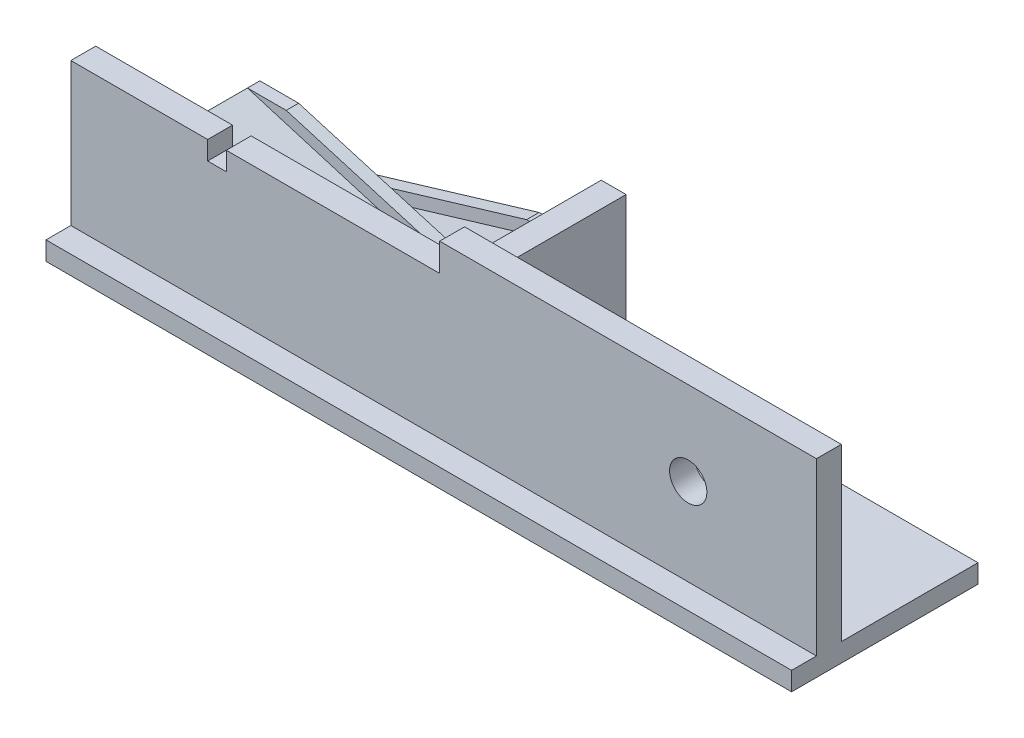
ISO-10303-21;
HEADER;
FILE_DESCRIPTION(('STEP AP214'),'2;1');
FILE_NAME('part.step','',(''),(''),'','','');
FILE_SCHEMA(('AUTOMOTIVE_DESIGN { 1 0 10303 214 1 1 1 1 }'));
ENDSEC;
DATA;
#1=APPLICATION_CONTEXT('core data for automotive mechanical design processes');
#2=APPLICATION_PROTOCOL_DEFINITION('international standard','automotive_design',2000,#1);
#3=PRODUCT_CONTEXT('',#1,'mechanical');
#4=PRODUCT('Part','Part','',(#3));
#5=PRODUCT_RELATED_PRODUCT_CATEGORY('part','',(#4));
#6=PRODUCT_DEFINITION_FORMATION('','',#4);
#7=PRODUCT_DEFINITION_CONTEXT('part definition',#1,'design');
#8=PRODUCT_DEFINITION('design','',#6,#7);
#9=PRODUCT_DEFINITION_SHAPE('','',#8);
#10=(LENGTH_UNIT() NAMED_UNIT(*) SI_UNIT(.MILLI.,.METRE.));
#11=(NAMED_UNIT(*) PLANE_ANGLE_UNIT() SI_UNIT($,.RADIAN.));
#12=(NAMED_UNIT(*) SI_UNIT($,.STERADIAN.) SOLID_ANGLE_UNIT());
#13=UNCERTAINTY_MEASURE_WITH_UNIT(LENGTH_MEASURE(1.E-05),#10,'distance_accuracy_value','');
#14=(GEOMETRIC_REPRESENTATION_CONTEXT(3) GLOBAL_UNCERTAINTY_ASSIGNED_CONTEXT((#13)) GLOBAL_UNIT_ASSIGNED_CONTEXT((#10,
#11,#12)) REPRESENTATION_CONTEXT('',''));
#15=CARTESIAN_POINT('',(0.,0.,0.));
#16=DIRECTION('',(0.,0.,1.));
#17=DIRECTION('',(1.,0.,0.));
#18=AXIS2_PLACEMENT_3D('',#15,#16,#17);
#19=CARTESIAN_POINT('',(-1000.,1450.,-1800.));
#20=DIRECTION('',(-0.287223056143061,-0.957863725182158,0.));
#21=DIRECTION('',(0.957863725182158,-0.287223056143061,0.));
#22=AXIS2_PLACEMENT_3D('',#19,#20,#21);
#23=PLANE('',#22);
#24=DIRECTION('',(0.957863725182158,-0.287223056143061,0.));
#25=VECTOR('',#24,1.);
#26=CARTESIAN_POINT('',(-1000.,1450.,-1600.));
#27=LINE('',#26,#25);
#28=CARTESIAN_POINT('',(-4294.07305936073,2437.75400549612,-1600.));
#29=VERTEX_POINT('',#28);
#30=CARTESIAN_POINT('',(-1000.,1450.,-1600.));
#31=VERTEX_POINT('',#30);
#32=EDGE_CURVE('E246',#29,#31,#27,.T.);
#33=ORIENTED_EDGE('',*,*,#32,.F.);
#34=DIRECTION('',(0.,0.,-1.));
#35=VECTOR('',#34,1.);
#36=CARTESIAN_POINT('',(-4294.07305936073,2437.75400549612,-1800.));
#37=LINE('',#36,#35);
#38=CARTESIAN_POINT('',(-4294.07305936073,2437.75400549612,-870.541736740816));
#39=VERTEX_POINT('',#38);
#40=EDGE_CURVE('E256',#39,#29,#37,.T.);
#41=ORIENTED_EDGE('',*,*,#40,.F.);
#42=DIRECTION('',(-0.950481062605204,0.285009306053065,0.123917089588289));
#43=VECTOR('',#42,1.);
#44=CARTESIAN_POINT('',(-941.109576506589,1432.34123814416,-1307.67772254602));
#45=LINE('',#44,#43);
#46=CARTESIAN_POINT('',(-4835.1492347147,2600.,-800.));
#47=VERTEX_POINT('',#46);
#48=EDGE_CURVE('E266',#39,#47,#45,.T.);
#49=ORIENTED_EDGE('',*,*,#48,.T.);
#50=DIRECTION('',(0.957863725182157,-0.287223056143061,0.));
#51=VECTOR('',#50,1.);
#52=CARTESIAN_POINT('',(-1000.,1450.,-800.));
#53=LINE('',#52,#51);
#54=CARTESIAN_POINT('',(-1000.,1450.,-800.));
#55=VERTEX_POINT('',#54);
#56=EDGE_CURVE('E327',#47,#55,#53,.T.);
#57=ORIENTED_EDGE('',*,*,#56,.T.);
#58=DIRECTION('',(0.,0.,1.));
#59=VECTOR('',#58,1.);
#60=CARTESIAN_POINT('',(-1000.,1450.,-1800.));
#61=LINE('',#60,#59);
#62=EDGE_CURVE('E258',#31,#55,#61,.T.);
#63=ORIENTED_EDGE('',*,*,#62,.F.);
#64=EDGE_LOOP('',(#33,#41,#49,#57,#63));
#65=FACE_BOUND('',#64,.T.);
#66=ADVANCED_FACE('F33',(#65),#23,.F.);
#67=CARTESIAN_POINT('',(0.,0.,-1800.));
#68=DIRECTION('',(0.,0.,-1.));
#69=DIRECTION('',(-1.,0.,0.));
#70=AXIS2_PLACEMENT_3D('',#67,#68,#69);
#71=PLANE('',#70);
#72=DIRECTION('',(-0.957863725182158,-0.287223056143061,0.));
#73=VECTOR('',#72,1.);
#74=CARTESIAN_POINT('',(-1000.,1450.,-1800.));
#75=LINE('',#74,#73);
#76=CARTESIAN_POINT('',(-1000.,1450.,-1800.));
#77=VERTEX_POINT('',#76);
#78=CARTESIAN_POINT('',(-4294.07305936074,462.245994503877,-1800.));
#79=VERTEX_POINT('',#78);
#80=EDGE_CURVE('E328',#77,#79,#75,.T.);
#81=ORIENTED_EDGE('',*,*,#80,.T.);
#82=DIRECTION('',(0.,-1.,0.));
#83=VECTOR('',#82,1.);
#84=CARTESIAN_POINT('',(-4294.07305936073,300.,-1800.));
#85=LINE('',#84,#83);
#86=CARTESIAN_POINT('',(-4294.07305936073,2437.75400549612,-1800.));
#87=VERTEX_POINT('',#86);
#88=EDGE_CURVE('E48',#87,#79,#85,.T.);
#89=ORIENTED_EDGE('',*,*,#88,.F.);
#90=DIRECTION('',(1.,0.,0.));
#91=VECTOR('',#90,1.);
#92=CARTESIAN_POINT('',(-4294.07305936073,2437.75400549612,-1800.));
#93=LINE('',#92,#91);
#94=CARTESIAN_POINT('',(-3670.18427617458,2437.75400549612,-1800.));
#95=VERTEX_POINT('',#94);
#96=EDGE_CURVE('E236',#87,#95,#93,.T.);
#97=ORIENTED_EDGE('',*,*,#96,.T.);
#98=DIRECTION('',(0.959131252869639,-0.282961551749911,0.));
#99=VECTOR('',#98,1.);
#100=CARTESIAN_POINT('',(-3670.18427617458,2437.75400549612,-1800.));
#101=LINE('',#100,#99);
#102=CARTESIAN_POINT('',(-1000.,1650.,-1800.));
#103=VERTEX_POINT('',#102);
#104=EDGE_CURVE('E915',#95,#103,#101,.T.);
#105=ORIENTED_EDGE('',*,*,#104,.T.);
#106=DIRECTION('',(0.,-1.,0.));
#107=VECTOR('',#106,1.);
#108=CARTESIAN_POINT('',(-1000.,1650.,-1800.));
#109=LINE('',#108,#107);
#110=EDGE_CURVE('E250',#103,#77,#109,.T.);
#111=ORIENTED_EDGE('',*,*,#110,.T.);
#112=EDGE_LOOP('',(#81,#89,#97,#105,#111));
#113=FACE_BOUND('',#112,.T.);
#114=ADVANCED_FACE('F486',(#113),#71,.T.);
#115=CARTESIAN_POINT('',(0.,300.,0.));
#116=DIRECTION('',(0.,-1.,0.));
#117=DIRECTION('',(0.,0.,-1.));
#118=AXIS2_PLACEMENT_3D('',#115,#116,#117);
#119=PLANE('',#118);
#120=DIRECTION('',(0.,0.,1.));
#121=VECTOR('',#120,1.);
#122=CARTESIAN_POINT('',(-4835.14923471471,300.,-3000.));
#123=LINE('',#122,#121);
#124=CARTESIAN_POINT('',(-4835.14923471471,300.,-3000.));
#125=VERTEX_POINT('',#124);
#126=CARTESIAN_POINT('',(-4835.14923471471,300.,-2800.));
#127=VERTEX_POINT('',#126);
#128=EDGE_CURVE('E295',#125,#127,#123,.T.);
#129=ORIENTED_EDGE('',*,*,#128,.F.);
#130=DIRECTION('',(-1.,0.,0.));
#131=VECTOR('',#130,1.);
#132=CARTESIAN_POINT('',(-5936.07305936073,300.,-3000.));
#133=LINE('',#132,#131);
#134=CARTESIAN_POINT('',(-5936.07305936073,300.,-3000.));
#135=VERTEX_POINT('',#134);
#136=EDGE_CURVE('E431',#125,#135,#133,.T.);
#137=ORIENTED_EDGE('',*,*,#136,.T.);
#138=DIRECTION('',(0.,0.,1.));
#139=VECTOR('',#138,1.);
#140=CARTESIAN_POINT('',(-5936.07305936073,300.,0.));
#141=LINE('',#140,#139);
#142=CARTESIAN_POINT('',(-5936.07305936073,300.,-1800.));
#143=VERTEX_POINT('',#142);
#144=EDGE_CURVE('E422',#135,#143,#141,.T.);
#145=ORIENTED_EDGE('',*,*,#144,.T.);
#146=DIRECTION('',(-1.,0.,0.));
#147=VECTOR('',#146,1.);
#148=CARTESIAN_POINT('',(-4835.14923471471,300.,-1800.));
#149=LINE('',#148,#147);
#150=CARTESIAN_POINT('',(-4835.14923471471,300.,-1800.));
#151=VERTEX_POINT('',#150);
#152=EDGE_CURVE('E331',#151,#143,#149,.T.);
#153=ORIENTED_EDGE('',*,*,#152,.F.);
#154=DIRECTION('',(0.,0.,1.));
#155=VECTOR('',#154,1.);
#156=CARTESIAN_POINT('',(-4835.14923471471,300.,-2800.));
#157=LINE('',#156,#155);
#158=EDGE_CURVE('E324',#127,#151,#157,.T.);
#159=ORIENTED_EDGE('',*,*,#158,.F.);
#160=EDGE_LOOP('',(#129,#137,#145,#153,#159));
#161=FACE_BOUND('',#160,.T.);
#162=ADVANCED_FACE('F492',(#161),#119,.F.);
#163=CARTESIAN_POINT('',(0.,2600.,-800.));
#164=DIRECTION('',(1.,0.,0.));
#165=DIRECTION('',(0.,0.,-1.));
#166=AXIS2_PLACEMENT_3D('',#163,#164,#165);
#167=PLANE('',#166);
#168=DIRECTION('',(0.,0.,1.));
#169=VECTOR('',#168,1.);
#170=CARTESIAN_POINT('',(0.,1650.,-3000.));
#171=LINE('',#170,#169);
#172=CARTESIAN_POINT('',(0.,1650.,-3000.));
#173=VERTEX_POINT('',#172);
#174=CARTESIAN_POINT('',(0.,1650.,-2800.));
#175=VERTEX_POINT('',#174);
#176=EDGE_CURVE('E56',#173,#175,#171,.T.);
#177=ORIENTED_EDGE('',*,*,#176,.T.);
#178=DIRECTION('',(0.,-1.,0.));
#179=VECTOR('',#178,1.);
#180=CARTESIAN_POINT('',(0.,1650.,-2800.));
#181=LINE('',#180,#179);
#182=CARTESIAN_POINT('',(0.,950.,-2800.));
#183=VERTEX_POINT('',#182);
#184=EDGE_CURVE('E290',#175,#183,#181,.T.);
#185=ORIENTED_EDGE('',*,*,#184,.T.);
#186=DIRECTION('',(0.,0.,1.));
#187=VECTOR('',#186,1.);
#188=CARTESIAN_POINT('',(0.,950.,-2800.));
#189=LINE('',#188,#187);
#190=CARTESIAN_POINT('',(0.,950.,-800.));
#191=VERTEX_POINT('',#190);
#192=EDGE_CURVE('E313',#183,#191,#189,.T.);
#193=ORIENTED_EDGE('',*,*,#192,.T.);
#194=DIRECTION('',(0.,-1.,0.));
#195=VECTOR('',#194,1.);
#196=CARTESIAN_POINT('',(0.,2600.,-800.));
#197=LINE('',#196,#195);
#198=CARTESIAN_POINT('',(0.,2600.,-800.));
#199=VERTEX_POINT('',#198);
#200=EDGE_CURVE('E372',#199,#191,#197,.T.);
#201=ORIENTED_EDGE('',*,*,#200,.F.);
#202=DIRECTION('',(0.,0.,1.));
#203=VECTOR('',#202,1.);
#204=CARTESIAN_POINT('',(0.,2600.,-800.));
#205=LINE('',#204,#203);
#206=CARTESIAN_POINT('',(0.,2600.,-3000.));
#207=VERTEX_POINT('',#206);
#208=EDGE_CURVE('E357',#207,#199,#205,.T.);
#209=ORIENTED_EDGE('',*,*,#208,.F.);
#210=DIRECTION('',(0.,-1.,0.));
#211=VECTOR('',#210,1.);
#212=CARTESIAN_POINT('',(0.,2600.,-3000.));
#213=LINE('',#212,#211);
#214=EDGE_CURVE('E364',#207,#173,#213,.T.);
#215=ORIENTED_EDGE('',*,*,#214,.T.);
#216=EDGE_LOOP('',(#177,#185,#193,#201,#209,#215));
#217=FACE_BOUND('',#216,.T.);
#218=ADVANCED_FACE('F504',(#217),#167,.F.);
#219=CARTESIAN_POINT('',(-5936.07305936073,2600.,-800.));
#220=DIRECTION('',(0.,0.,1.));
#221=DIRECTION('',(1.,0.,0.));
#222=AXIS2_PLACEMENT_3D('',#219,#220,#221);
#223=PLANE('',#222);
#224=DIRECTION('',(0.,-1.,0.));
#225=VECTOR('',#224,1.);
#226=CARTESIAN_POINT('',(-1000.,1450.,-800.));
#227=LINE('',#226,#225);
#228=CARTESIAN_POINT('',(-1000.,950.,-800.));
#229=VERTEX_POINT('',#228);
#230=EDGE_CURVE('E302',#55,#229,#227,.T.);
#231=ORIENTED_EDGE('',*,*,#230,.F.);
#232=ORIENTED_EDGE('',*,*,#56,.F.);
#233=DIRECTION('',(-1.,0.,0.));
#234=VECTOR('',#233,1.);
#235=CARTESIAN_POINT('',(-5936.07305936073,2600.,-800.));
#236=LINE('',#235,#234);
#237=CARTESIAN_POINT('',(-3734.22541006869,2600.,-800.));
#238=VERTEX_POINT('',#237);
#239=EDGE_CURVE('E405',#238,#47,#236,.T.);
#240=ORIENTED_EDGE('',*,*,#239,.F.);
#241=DIRECTION('',(0.,-1.,0.));
#242=VECTOR('',#241,1.);
#243=CARTESIAN_POINT('',(-3734.22541006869,2600.,-800.));
#244=LINE('',#243,#242);
#245=CARTESIAN_POINT('',(-3734.22541006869,2300.,-800.));
#246=VERTEX_POINT('',#245);
#247=EDGE_CURVE('E394',#238,#246,#244,.T.);
#248=ORIENTED_EDGE('',*,*,#247,.T.);
#249=DIRECTION('',(1.,0.,0.));
#250=VECTOR('',#249,1.);
#251=CARTESIAN_POINT('',(-5936.07305936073,2300.,-800.));
#252=LINE('',#251,#250);
#253=CARTESIAN_POINT('',(-3434.22541006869,2300.,-800.));
#254=VERTEX_POINT('',#253);
#255=EDGE_CURVE('E41',#246,#254,#252,.T.);
#256=ORIENTED_EDGE('',*,*,#255,.T.);
#257=DIRECTION('',(0.,1.,0.));
#258=VECTOR('',#257,1.);
#259=CARTESIAN_POINT('',(-3434.22541006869,2600.,-800.));
#260=LINE('',#259,#258);
#261=CARTESIAN_POINT('',(-3434.22541006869,2600.,-800.));
#262=VERTEX_POINT('',#261);
#263=EDGE_CURVE('E390',#254,#262,#260,.T.);
#264=ORIENTED_EDGE('',*,*,#263,.T.);
#265=EDGE_CURVE('E406',#199,#262,#236,.T.);
#266=ORIENTED_EDGE('',*,*,#265,.F.);
#267=ORIENTED_EDGE('',*,*,#200,.T.);
#268=DIRECTION('',(1.,0.,0.));
#269=VECTOR('',#268,1.);
#270=CARTESIAN_POINT('',(-1000.,950.,-800.));
#271=LINE('',#270,#269);
#272=EDGE_CURVE('E307',#229,#191,#271,.T.);
#273=ORIENTED_EDGE('',*,*,#272,.F.);
#274=EDGE_LOOP('',(#231,#232,#240,#248,#256,#264,#266,#267,#273));
#275=FACE_BOUND('',#274,.T.);
#276=ADVANCED_FACE('F506',(#275),#223,.F.);
#277=CARTESIAN_POINT('',(0.,2600.,0.));
#278=DIRECTION('',(0.,-1.,0.));
#279=DIRECTION('',(0.,0.,-1.));
#280=AXIS2_PLACEMENT_3D('',#277,#278,#279);
#281=PLANE('',#280);
#282=DIRECTION('',(0.,0.,1.));
#283=VECTOR('',#282,1.);
#284=CARTESIAN_POINT('',(0.,2600.,-400.));
#285=LINE('',#284,#283);
#286=CARTESIAN_POINT('',(0.,2600.,-400.));
#287=VERTEX_POINT('',#286);
#288=EDGE_CURVE('E336',#199,#287,#285,.T.);
#289=ORIENTED_EDGE('',*,*,#288,.F.);
#290=ORIENTED_EDGE('',*,*,#265,.T.);
#291=DIRECTION('',(0.,0.,1.));
#292=VECTOR('',#291,1.);
#293=CARTESIAN_POINT('',(-3434.22541006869,2600.,0.));
#294=LINE('',#293,#292);
#295=CARTESIAN_POINT('',(-3434.22541006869,2600.,-400.));
#296=VERTEX_POINT('',#295);
#297=EDGE_CURVE('E455',#262,#296,#294,.T.);
#298=ORIENTED_EDGE('',*,*,#297,.T.);
#299=DIRECTION('',(1.,0.,0.));
#300=VECTOR('',#299,1.);
#301=CARTESIAN_POINT('',(-5936.07305936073,2600.,-400.));
#302=LINE('',#301,#300);
#303=EDGE_CURVE('E400',#296,#287,#302,.T.);
#304=ORIENTED_EDGE('',*,*,#303,.T.);
#305=EDGE_LOOP('',(#289,#290,#298,#304));
#306=FACE_BOUND('',#305,.T.);
#307=ADVANCED_FACE('F511',(#306),#281,.F.);
#308=DIRECTION('',(-1.,0.,0.));
#309=VECTOR('',#308,1.);
#310=CARTESIAN_POINT('',(0.,2600.,-800.));
#311=LINE('',#310,#309);
#312=CARTESIAN_POINT('',(400.,2600.,-800.));
#313=VERTEX_POINT('',#312);
#314=EDGE_CURVE('E11',#313,#199,#311,.T.);
#315=ORIENTED_EDGE('',*,*,#314,.F.);
#316=DIRECTION('',(0.,0.,-1.));
#317=VECTOR('',#316,1.);
#318=CARTESIAN_POINT('',(400.,2600.,-800.));
#319=LINE('',#318,#317);
#320=CARTESIAN_POINT('',(400.,2600.,-3000.));
#321=VERTEX_POINT('',#320);
#322=EDGE_CURVE('E360',#313,#321,#319,.T.);
#323=ORIENTED_EDGE('',*,*,#322,.T.);
#324=DIRECTION('',(-1.,0.,0.));
#325=VECTOR('',#324,1.);
#326=CARTESIAN_POINT('',(0.,2600.,-3000.));
#327=LINE('',#326,#325);
#328=EDGE_CURVE('E362',#321,#207,#327,.T.);
#329=ORIENTED_EDGE('',*,*,#328,.T.);
#330=ORIENTED_EDGE('',*,*,#208,.T.);
#331=EDGE_LOOP('',(#315,#323,#329,#330));
#332=FACE_BOUND('',#331,.T.);
#333=ADVANCED_FACE('F524',(#332),#281,.F.);
#334=DIRECTION('',(0.,0.,-1.));
#335=VECTOR('',#334,1.);
#336=CARTESIAN_POINT('',(400.,300.,-800.));
#337=LINE('',#336,#335);
#338=CARTESIAN_POINT('',(400.,300.,-800.));
#339=VERTEX_POINT('',#338);
#340=CARTESIAN_POINT('',(400.,300.,-3000.));
#341=VERTEX_POINT('',#340);
#342=EDGE_CURVE('E356',#339,#341,#337,.T.);
#343=ORIENTED_EDGE('',*,*,#342,.F.);
#344=DIRECTION('',(-1.,0.,0.));
#345=VECTOR('',#344,1.);
#346=CARTESIAN_POINT('',(-5936.07305936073,300.,-800.));
#347=LINE('',#346,#345);
#348=CARTESIAN_POINT('',(6063.92694063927,300.,-800.));
#349=VERTEX_POINT('',#348);
#350=EDGE_CURVE('E401',#349,#339,#347,.T.);
#351=ORIENTED_EDGE('',*,*,#350,.F.);
#352=DIRECTION('',(0.,0.,-1.));
#353=VECTOR('',#352,1.);
#354=CARTESIAN_POINT('',(6063.92694063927,300.,0.));
#355=LINE('',#354,#353);
#356=CARTESIAN_POINT('',(6063.92694063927,300.,-3000.));
#357=VERTEX_POINT('',#356);
#358=EDGE_CURVE('E428',#349,#357,#355,.T.);
#359=ORIENTED_EDGE('',*,*,#358,.T.);
#360=EDGE_CURVE('E432',#357,#341,#133,.T.);
#361=ORIENTED_EDGE('',*,*,#360,.T.);
#362=EDGE_LOOP('',(#343,#351,#359,#361));
#363=FACE_BOUND('',#362,.T.);
#364=ADVANCED_FACE('F517',(#363),#119,.F.);
#365=CARTESIAN_POINT('',(4000.,1700.,-800.));
#366=DIRECTION('',(0.,0.,1.));
#367=DIRECTION('',(1.,0.,0.));
#368=AXIS2_PLACEMENT_3D('',#365,#366,#367);
#369=CIRCLE('',#368,300.);
#370=CARTESIAN_POINT('',(4300.,1700.,-800.));
#371=VERTEX_POINT('',#370);
#372=EDGE_CURVE('E378',#371,#371,#369,.T.);
#373=ORIENTED_EDGE('',*,*,#372,.T.);
#374=EDGE_LOOP('',(#373));
#375=FACE_BOUND('',#374,.T.);
#376=DIRECTION('',(0.,-1.,0.));
#377=VECTOR('',#376,1.);
#378=CARTESIAN_POINT('',(400.,2600.,-800.));
#379=LINE('',#378,#377);
#380=EDGE_CURVE('E370',#313,#339,#379,.T.);
#381=ORIENTED_EDGE('',*,*,#380,.F.);
#382=ORIENTED_EDGE('',*,*,#314,.T.);
#383=DIRECTION('',(0.,-1.,0.));
#384=VECTOR('',#383,1.);
#385=CARTESIAN_POINT('',(0.,3050.,-800.));
#386=LINE('',#385,#384);
#387=CARTESIAN_POINT('',(0.,3050.,-800.));
#388=VERTEX_POINT('',#387);
#389=EDGE_CURVE('E348',#388,#199,#386,.T.);
#390=ORIENTED_EDGE('',*,*,#389,.F.);
#391=DIRECTION('',(-1.,0.,0.));
#392=VECTOR('',#391,1.);
#393=CARTESIAN_POINT('',(0.,3050.,-800.));
#394=LINE('',#393,#392);
#395=CARTESIAN_POINT('',(6063.92694063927,3050.,-800.));
#396=VERTEX_POINT('',#395);
#397=EDGE_CURVE('E346',#396,#388,#394,.T.);
#398=ORIENTED_EDGE('',*,*,#397,.F.);
#399=DIRECTION('',(0.,-1.,0.));
#400=VECTOR('',#399,1.);
#401=CARTESIAN_POINT('',(6063.92694063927,2600.,-800.));
#402=LINE('',#401,#400);
#403=EDGE_CURVE('E408',#396,#349,#402,.T.);
#404=ORIENTED_EDGE('',*,*,#403,.T.);
#405=ORIENTED_EDGE('',*,*,#350,.T.);
#406=EDGE_LOOP('',(#381,#382,#390,#398,#404,#405));
#407=FACE_BOUND('',#406,.T.);
#408=ADVANCED_FACE('F465',(#375,#407),#223,.F.);
#409=ORIENTED_EDGE('',*,*,#239,.T.);
#410=DIRECTION('',(-1.,0.,0.));
#411=VECTOR('',#410,1.);
#412=CARTESIAN_POINT('',(-4294.07305936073,2600.,-800.));
#413=LINE('',#412,#411);
#414=CARTESIAN_POINT('',(-5936.07305936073,2600.,-800.));
#415=VERTEX_POINT('',#414);
#416=EDGE_CURVE('E267',#47,#415,#413,.T.);
#417=ORIENTED_EDGE('',*,*,#416,.T.);
#418=DIRECTION('',(0.,0.,1.));
#419=VECTOR('',#418,1.);
#420=CARTESIAN_POINT('',(-5936.07305936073,2600.,-400.));
#421=LINE('',#420,#419);
#422=CARTESIAN_POINT('',(-5936.07305936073,2600.,-400.));
#423=VERTEX_POINT('',#422);
#424=EDGE_CURVE('E398',#415,#423,#421,.T.);
#425=ORIENTED_EDGE('',*,*,#424,.T.);
#426=CARTESIAN_POINT('',(-3734.22541006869,2600.,-400.));
#427=VERTEX_POINT('',#426);
#428=EDGE_CURVE('E402',#423,#427,#302,.T.);
#429=ORIENTED_EDGE('',*,*,#428,.T.);
#430=DIRECTION('',(0.,0.,-1.));
#431=VECTOR('',#430,1.);
#432=CARTESIAN_POINT('',(-3734.22541006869,2600.,0.));
#433=LINE('',#432,#431);
#434=EDGE_CURVE('E458',#427,#238,#433,.T.);
#435=ORIENTED_EDGE('',*,*,#434,.T.);
#436=EDGE_LOOP('',(#409,#417,#425,#429,#435));
#437=FACE_BOUND('',#436,.T.);
#438=ADVANCED_FACE('F527',(#437),#281,.F.);
#439=DIRECTION('',(1.,0.,0.));
#440=VECTOR('',#439,1.);
#441=CARTESIAN_POINT('',(-5936.07305936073,300.,-400.));
#442=LINE('',#441,#440);
#443=CARTESIAN_POINT('',(-5936.07305936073,300.,-400.));
#444=VERTEX_POINT('',#443);
#445=CARTESIAN_POINT('',(6063.92694063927,300.,-400.));
#446=VERTEX_POINT('',#445);
#447=EDGE_CURVE('E397',#444,#446,#442,.T.);
#448=ORIENTED_EDGE('',*,*,#447,.F.);
#449=CARTESIAN_POINT('',(-5936.07305936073,300.,0.));
#450=VERTEX_POINT('',#449);
#451=EDGE_CURVE('E426',#444,#450,#141,.T.);
#452=ORIENTED_EDGE('',*,*,#451,.T.);
#453=DIRECTION('',(1.,0.,0.));
#454=VECTOR('',#453,1.);
#455=CARTESIAN_POINT('',(-5936.07305936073,300.,0.));
#456=LINE('',#455,#454);
#457=CARTESIAN_POINT('',(6063.92694063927,300.,0.));
#458=VERTEX_POINT('',#457);
#459=EDGE_CURVE('E425',#450,#458,#456,.T.);
#460=ORIENTED_EDGE('',*,*,#459,.T.);
#461=EDGE_CURVE('E429',#458,#446,#355,.T.);
#462=ORIENTED_EDGE('',*,*,#461,.T.);
#463=EDGE_LOOP('',(#448,#452,#460,#462));
#464=FACE_BOUND('',#463,.T.);
#465=ADVANCED_FACE('F518',(#464),#119,.F.);
#466=CARTESIAN_POINT('',(-5936.07305936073,300.,0.));
#467=DIRECTION('',(1.,0.,0.));
#468=DIRECTION('',(0.,0.,-1.));
#469=AXIS2_PLACEMENT_3D('',#466,#467,#468);
#470=PLANE('',#469);
#471=ORIENTED_EDGE('',*,*,#424,.F.);
#472=DIRECTION('',(0.,0.917070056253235,0.39872611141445));
#473=VECTOR('',#472,1.);
#474=CARTESIAN_POINT('',(-5936.07305936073,2600.,-800.));
#475=LINE('',#474,#473);
#476=EDGE_CURVE('E259',#143,#415,#475,.T.);
#477=ORIENTED_EDGE('',*,*,#476,.F.);
#478=ORIENTED_EDGE('',*,*,#144,.F.);
#479=DIRECTION('',(0.,-1.,0.));
#480=VECTOR('',#479,1.);
#481=CARTESIAN_POINT('',(-5936.07305936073,300.,-3000.));
#482=LINE('',#481,#480);
#483=CARTESIAN_POINT('',(-5936.07305936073,0.,-3000.));
#484=VERTEX_POINT('',#483);
#485=EDGE_CURVE('E435',#135,#484,#482,.T.);
#486=ORIENTED_EDGE('',*,*,#485,.T.);
#487=DIRECTION('',(0.,0.,1.));
#488=VECTOR('',#487,1.);
#489=CARTESIAN_POINT('',(-5936.07305936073,0.,0.));
#490=LINE('',#489,#488);
#491=CARTESIAN_POINT('',(-5936.07305936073,0.,0.));
#492=VERTEX_POINT('',#491);
#493=EDGE_CURVE('E421',#484,#492,#490,.T.);
#494=ORIENTED_EDGE('',*,*,#493,.T.);
#495=DIRECTION('',(0.,-1.,0.));
#496=VECTOR('',#495,1.);
#497=CARTESIAN_POINT('',(-5936.07305936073,300.,0.));
#498=LINE('',#497,#496);
#499=EDGE_CURVE('E452',#450,#492,#498,.T.);
#500=ORIENTED_EDGE('',*,*,#499,.F.);
#501=ORIENTED_EDGE('',*,*,#451,.F.);
#502=DIRECTION('',(0.,-1.,0.));
#503=VECTOR('',#502,1.);
#504=CARTESIAN_POINT('',(-5936.07305936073,2600.,-400.));
#505=LINE('',#504,#503);
#506=EDGE_CURVE('E418',#423,#444,#505,.T.);
#507=ORIENTED_EDGE('',*,*,#506,.F.);
#508=EDGE_LOOP('',(#471,#477,#478,#486,#494,#500,#501,#507));
#509=FACE_BOUND('',#508,.T.);
#510=ADVANCED_FACE('F35',(#509),#470,.F.);
#511=CARTESIAN_POINT('',(-5936.07305936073,300.,0.));
#512=DIRECTION('',(0.,0.,-1.));
#513=DIRECTION('',(-1.,0.,0.));
#514=AXIS2_PLACEMENT_3D('',#511,#512,#513);
#515=PLANE('',#514);
#516=DIRECTION('',(1.,0.,0.));
#517=VECTOR('',#516,1.);
#518=CARTESIAN_POINT('',(-5936.07305936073,0.,0.));
#519=LINE('',#518,#517);
#520=CARTESIAN_POINT('',(6063.92694063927,0.,0.));
#521=VERTEX_POINT('',#520);
#522=EDGE_CURVE('E438',#492,#521,#519,.T.);
#523=ORIENTED_EDGE('',*,*,#522,.T.);
#524=DIRECTION('',(0.,-1.,0.));
#525=VECTOR('',#524,1.);
#526=CARTESIAN_POINT('',(6063.92694063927,300.,0.));
#527=LINE('',#526,#525);
#528=EDGE_CURVE('E449',#458,#521,#527,.T.);
#529=ORIENTED_EDGE('',*,*,#528,.F.);
#530=ORIENTED_EDGE('',*,*,#459,.F.);
#531=ORIENTED_EDGE('',*,*,#499,.T.);
#532=EDGE_LOOP('',(#523,#529,#530,#531));
#533=FACE_BOUND('',#532,.T.);
#534=ADVANCED_FACE('F533',(#533),#515,.F.);
#535=CARTESIAN_POINT('',(6063.92694063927,300.,0.));
#536=DIRECTION('',(-1.,0.,0.));
#537=DIRECTION('',(0.,0.,1.));
#538=AXIS2_PLACEMENT_3D('',#535,#536,#537);
#539=PLANE('',#538);
#540=DIRECTION('',(0.,0.,-1.));
#541=VECTOR('',#540,1.);
#542=CARTESIAN_POINT('',(6063.92694063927,0.,0.));
#543=LINE('',#542,#541);
#544=CARTESIAN_POINT('',(6063.92694063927,0.,-3000.));
#545=VERTEX_POINT('',#544);
#546=EDGE_CURVE('E440',#521,#545,#543,.T.);
#547=ORIENTED_EDGE('',*,*,#546,.T.);
#548=DIRECTION('',(0.,-1.,0.));
#549=VECTOR('',#548,1.);
#550=CARTESIAN_POINT('',(6063.92694063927,300.,-3000.));
#551=LINE('',#550,#549);
#552=EDGE_CURVE('E446',#357,#545,#551,.T.);
#553=ORIENTED_EDGE('',*,*,#552,.F.);
#554=ORIENTED_EDGE('',*,*,#358,.F.);
#555=ORIENTED_EDGE('',*,*,#403,.F.);
#556=DIRECTION('',(0.,0.,-1.));
#557=VECTOR('',#556,1.);
#558=CARTESIAN_POINT('',(6063.92694063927,3050.,-400.));
#559=LINE('',#558,#557);
#560=CARTESIAN_POINT('',(6063.92694063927,3050.,-400.));
#561=VERTEX_POINT('',#560);
#562=EDGE_CURVE('E343',#561,#396,#559,.T.);
#563=ORIENTED_EDGE('',*,*,#562,.F.);
#564=DIRECTION('',(0.,-1.,0.));
#565=VECTOR('',#564,1.);
#566=CARTESIAN_POINT('',(6063.92694063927,2600.,-400.));
#567=LINE('',#566,#565);
#568=EDGE_CURVE('E415',#561,#446,#567,.T.);
#569=ORIENTED_EDGE('',*,*,#568,.T.);
#570=ORIENTED_EDGE('',*,*,#461,.F.);
#571=ORIENTED_EDGE('',*,*,#528,.T.);
#572=EDGE_LOOP('',(#547,#553,#554,#555,#563,#569,#570,#571));
#573=FACE_BOUND('',#572,.T.);
#574=ADVANCED_FACE('F571',(#573),#539,.F.);
#575=CARTESIAN_POINT('',(-5936.07305936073,300.,-3000.));
#576=DIRECTION('',(0.,0.,1.));
#577=DIRECTION('',(1.,0.,0.));
#578=AXIS2_PLACEMENT_3D('',#575,#576,#577);
#579=PLANE('',#578);
#580=DIRECTION('',(-1.,0.,0.));
#581=VECTOR('',#580,1.);
#582=CARTESIAN_POINT('',(-5936.07305936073,0.,-3000.));
#583=LINE('',#582,#581);
#584=EDGE_CURVE('E442',#545,#484,#583,.T.);
#585=ORIENTED_EDGE('',*,*,#584,.T.);
#586=ORIENTED_EDGE('',*,*,#485,.F.);
#587=ORIENTED_EDGE('',*,*,#136,.F.);
#588=DIRECTION('',(0.,1.,0.));
#589=VECTOR('',#588,1.);
#590=CARTESIAN_POINT('',(-4835.14923471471,300.,-3000.));
#591=LINE('',#590,#589);
#592=CARTESIAN_POINT('',(-4835.14923471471,500.,-3000.));
#593=VERTEX_POINT('',#592);
#594=EDGE_CURVE('E283',#125,#593,#591,.T.);
#595=ORIENTED_EDGE('',*,*,#594,.T.);
#596=DIRECTION('',(0.957863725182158,0.287223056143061,0.));
#597=VECTOR('',#596,1.);
#598=CARTESIAN_POINT('',(-4835.14923471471,500.,-3000.));
#599=LINE('',#598,#597);
#600=CARTESIAN_POINT('',(-1000.,1650.,-3000.));
#601=VERTEX_POINT('',#600);
#602=EDGE_CURVE('E276',#593,#601,#599,.T.);
#603=ORIENTED_EDGE('',*,*,#602,.T.);
#604=DIRECTION('',(1.,0.,0.));
#605=VECTOR('',#604,1.);
#606=CARTESIAN_POINT('',(-1000.,1650.,-3000.));
#607=LINE('',#606,#605);
#608=EDGE_CURVE('E279',#601,#173,#607,.T.);
#609=ORIENTED_EDGE('',*,*,#608,.T.);
#610=ORIENTED_EDGE('',*,*,#214,.F.);
#611=ORIENTED_EDGE('',*,*,#328,.F.);
#612=DIRECTION('',(0.,-1.,0.));
#613=VECTOR('',#612,1.);
#614=CARTESIAN_POINT('',(400.,2600.,-3000.));
#615=LINE('',#614,#613);
#616=EDGE_CURVE('E367',#321,#341,#615,.T.);
#617=ORIENTED_EDGE('',*,*,#616,.T.);
#618=ORIENTED_EDGE('',*,*,#360,.F.);
#619=ORIENTED_EDGE('',*,*,#552,.T.);
#620=EDGE_LOOP('',(#585,#586,#587,#595,#603,#609,#610,#611,#617,#618,#619));
#621=FACE_BOUND('',#620,.T.);
#622=ADVANCED_FACE('F562',(#621),#579,.F.);
#623=CARTESIAN_POINT('',(0.,0.,0.));
#624=DIRECTION('',(0.,-1.,0.));
#625=DIRECTION('',(0.,0.,-1.));
#626=AXIS2_PLACEMENT_3D('',#623,#624,#625);
#627=PLANE('',#626);
#628=ORIENTED_EDGE('',*,*,#493,.F.);
#629=ORIENTED_EDGE('',*,*,#584,.F.);
#630=ORIENTED_EDGE('',*,*,#546,.F.);
#631=ORIENTED_EDGE('',*,*,#522,.F.);
#632=EDGE_LOOP('',(#628,#629,#630,#631));
#633=FACE_BOUND('',#632,.T.);
#634=ADVANCED_FACE('F566',(#633),#627,.T.);
#635=CARTESIAN_POINT('',(-5936.07305936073,2600.,-400.));
#636=DIRECTION('',(0.,0.,-1.));
#637=DIRECTION('',(-1.,0.,0.));
#638=AXIS2_PLACEMENT_3D('',#635,#636,#637);
#639=PLANE('',#638);
#640=CARTESIAN_POINT('',(4000.,1700.,-400.));
#641=DIRECTION('',(0.,0.,1.));
#642=DIRECTION('',(1.,0.,0.));
#643=AXIS2_PLACEMENT_3D('',#640,#641,#642);
#644=CIRCLE('',#643,300.);
#645=CARTESIAN_POINT('',(4300.,1700.,-400.));
#646=VERTEX_POINT('',#645);
#647=EDGE_CURVE('E375',#646,#646,#644,.T.);
#648=ORIENTED_EDGE('',*,*,#647,.F.);
#649=EDGE_LOOP('',(#648));
#650=FACE_BOUND('',#649,.T.);
#651=DIRECTION('',(1.,0.,0.));
#652=VECTOR('',#651,1.);
#653=CARTESIAN_POINT('',(-3734.22541006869,2300.,-400.));
#654=LINE('',#653,#652);
#655=CARTESIAN_POINT('',(-3734.22541006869,2300.,-400.));
#656=VERTEX_POINT('',#655);
#657=CARTESIAN_POINT('',(-3434.22541006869,2300.,-400.));
#658=VERTEX_POINT('',#657);
#659=EDGE_CURVE('E382',#656,#658,#654,.T.);
#660=ORIENTED_EDGE('',*,*,#659,.F.);
#661=DIRECTION('',(0.,-1.,0.));
#662=VECTOR('',#661,1.);
#663=CARTESIAN_POINT('',(-3734.22541006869,2600.,-400.));
#664=LINE('',#663,#662);
#665=EDGE_CURVE('E379',#427,#656,#664,.T.);
#666=ORIENTED_EDGE('',*,*,#665,.F.);
#667=ORIENTED_EDGE('',*,*,#428,.F.);
#668=ORIENTED_EDGE('',*,*,#506,.T.);
#669=ORIENTED_EDGE('',*,*,#447,.T.);
#670=ORIENTED_EDGE('',*,*,#568,.F.);
#671=DIRECTION('',(1.,0.,0.));
#672=VECTOR('',#671,1.);
#673=CARTESIAN_POINT('',(0.,3050.,-400.));
#674=LINE('',#673,#672);
#675=CARTESIAN_POINT('',(0.,3050.,-400.));
#676=VERTEX_POINT('',#675);
#677=EDGE_CURVE('E340',#676,#561,#674,.T.);
#678=ORIENTED_EDGE('',*,*,#677,.F.);
#679=DIRECTION('',(0.,-1.,0.));
#680=VECTOR('',#679,1.);
#681=CARTESIAN_POINT('',(0.,3050.,-400.));
#682=LINE('',#681,#680);
#683=EDGE_CURVE('E353',#676,#287,#682,.T.);
#684=ORIENTED_EDGE('',*,*,#683,.T.);
#685=ORIENTED_EDGE('',*,*,#303,.F.);
#686=DIRECTION('',(0.,1.,0.));
#687=VECTOR('',#686,1.);
#688=CARTESIAN_POINT('',(-3434.22541006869,2600.,-400.));
#689=LINE('',#688,#687);
#690=EDGE_CURVE('E385',#658,#296,#689,.T.);
#691=ORIENTED_EDGE('',*,*,#690,.F.);
#692=EDGE_LOOP('',(#660,#666,#667,#668,#669,#670,#678,#684,#685,#691));
#693=FACE_BOUND('',#692,.T.);
#694=ADVANCED_FACE('F547',(#650,#693),#639,.F.);
#695=CARTESIAN_POINT('',(-3734.22541006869,2300.,-2700.));
#696=DIRECTION('',(0.,-1.,0.));
#697=DIRECTION('',(0.,0.,-1.));
#698=AXIS2_PLACEMENT_3D('',#695,#696,#697);
#699=PLANE('',#698);
#700=DIRECTION('',(0.,0.,1.));
#701=VECTOR('',#700,1.);
#702=CARTESIAN_POINT('',(-3734.22541006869,2300.,-2700.));
#703=LINE('',#702,#701);
#704=EDGE_CURVE('E387',#246,#656,#703,.T.);
#705=ORIENTED_EDGE('',*,*,#704,.T.);
#706=ORIENTED_EDGE('',*,*,#659,.T.);
#707=DIRECTION('',(0.,0.,1.));
#708=VECTOR('',#707,1.);
#709=CARTESIAN_POINT('',(-3434.22541006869,2300.,-2700.));
#710=LINE('',#709,#708);
#711=EDGE_CURVE('E388',#254,#658,#710,.T.);
#712=ORIENTED_EDGE('',*,*,#711,.F.);
#713=ORIENTED_EDGE('',*,*,#255,.F.);
#714=EDGE_LOOP('',(#705,#706,#712,#713));
#715=FACE_BOUND('',#714,.T.);
#716=ADVANCED_FACE('F586',(#715),#699,.F.);
#717=CARTESIAN_POINT('',(-3734.22541006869,2600.,-2700.));
#718=DIRECTION('',(-1.,0.,0.));
#719=DIRECTION('',(0.,0.,1.));
#720=AXIS2_PLACEMENT_3D('',#717,#718,#719);
#721=PLANE('',#720);
#722=ORIENTED_EDGE('',*,*,#434,.F.);
#723=ORIENTED_EDGE('',*,*,#665,.T.);
#724=ORIENTED_EDGE('',*,*,#704,.F.);
#725=ORIENTED_EDGE('',*,*,#247,.F.);
#726=EDGE_LOOP('',(#722,#723,#724,#725));
#727=FACE_BOUND('',#726,.T.);
#728=ADVANCED_FACE('F481',(#727),#721,.F.);
#729=CARTESIAN_POINT('',(-3434.22541006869,2600.,-2700.));
#730=DIRECTION('',(1.,0.,0.));
#731=DIRECTION('',(0.,0.,-1.));
#732=AXIS2_PLACEMENT_3D('',#729,#730,#731);
#733=PLANE('',#732);
#734=ORIENTED_EDGE('',*,*,#711,.T.);
#735=ORIENTED_EDGE('',*,*,#690,.T.);
#736=ORIENTED_EDGE('',*,*,#297,.F.);
#737=ORIENTED_EDGE('',*,*,#263,.F.);
#738=EDGE_LOOP('',(#734,#735,#736,#737));
#739=FACE_BOUND('',#738,.T.);
#740=ADVANCED_FACE('F471',(#739),#733,.F.);
#741=CARTESIAN_POINT('',(4000.,1700.,-2700.));
#742=DIRECTION('',(0.,0.,1.));
#743=DIRECTION('',(1.,0.,0.));
#744=AXIS2_PLACEMENT_3D('',#741,#742,#743);
#745=CYLINDRICAL_SURFACE('',#744,300.);
#746=ORIENTED_EDGE('',*,*,#647,.T.);
#747=EDGE_LOOP('',(#746));
#748=FACE_BOUND('',#747,.T.);
#749=ORIENTED_EDGE('',*,*,#372,.F.);
#750=EDGE_LOOP('',(#749));
#751=FACE_BOUND('',#750,.T.);
#752=ADVANCED_FACE('F468',(#748,#751),#745,.F.);
#753=CARTESIAN_POINT('',(400.,2600.,-800.));
#754=DIRECTION('',(-1.,0.,0.));
#755=DIRECTION('',(0.,0.,1.));
#756=AXIS2_PLACEMENT_3D('',#753,#754,#755);
#757=PLANE('',#756);
#758=ORIENTED_EDGE('',*,*,#342,.T.);
#759=ORIENTED_EDGE('',*,*,#616,.F.);
#760=ORIENTED_EDGE('',*,*,#322,.F.);
#761=ORIENTED_EDGE('',*,*,#380,.T.);
#762=EDGE_LOOP('',(#758,#759,#760,#761));
#763=FACE_BOUND('',#762,.T.);
#764=ADVANCED_FACE('F470',(#763),#757,.F.);
#765=CARTESIAN_POINT('',(0.,3050.,-400.));
#766=DIRECTION('',(1.,0.,0.));
#767=DIRECTION('',(0.,0.,-1.));
#768=AXIS2_PLACEMENT_3D('',#765,#766,#767);
#769=PLANE('',#768);
#770=ORIENTED_EDGE('',*,*,#288,.T.);
#771=ORIENTED_EDGE('',*,*,#683,.F.);
#772=DIRECTION('',(0.,0.,1.));
#773=VECTOR('',#772,1.);
#774=CARTESIAN_POINT('',(0.,3050.,-400.));
#775=LINE('',#774,#773);
#776=EDGE_CURVE('E337',#388,#676,#775,.T.);
#777=ORIENTED_EDGE('',*,*,#776,.F.);
#778=ORIENTED_EDGE('',*,*,#389,.T.);
#779=EDGE_LOOP('',(#770,#771,#777,#778));
#780=FACE_BOUND('',#779,.T.);
#781=ADVANCED_FACE('F478',(#780),#769,.F.);
#782=CARTESIAN_POINT('',(0.,3050.,0.));
#783=DIRECTION('',(0.,-1.,0.));
#784=DIRECTION('',(0.,0.,-1.));
#785=AXIS2_PLACEMENT_3D('',#782,#783,#784);
#786=PLANE('',#785);
#787=ORIENTED_EDGE('',*,*,#776,.T.);
#788=ORIENTED_EDGE('',*,*,#677,.T.);
#789=ORIENTED_EDGE('',*,*,#562,.T.);
#790=ORIENTED_EDGE('',*,*,#397,.T.);
#791=EDGE_LOOP('',(#787,#788,#789,#790));
#792=FACE_BOUND('',#791,.T.);
#793=ADVANCED_FACE('F497',(#792),#786,.F.);
#794=CARTESIAN_POINT('',(-4835.14923471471,300.,-2800.));
#795=DIRECTION('',(0.287223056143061,-0.957863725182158,0.));
#796=DIRECTION('',(0.957863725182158,0.287223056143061,0.));
#797=AXIS2_PLACEMENT_3D('',#794,#795,#796);
#798=PLANE('',#797);
#799=ORIENTED_EDGE('',*,*,#80,.F.);
#800=DIRECTION('',(0.,0.,1.));
#801=VECTOR('',#800,1.);
#802=CARTESIAN_POINT('',(-1000.,1450.,-2800.));
#803=LINE('',#802,#801);
#804=CARTESIAN_POINT('',(-1000.,1450.,-2800.));
#805=VERTEX_POINT('',#804);
#806=EDGE_CURVE('E321',#805,#77,#803,.T.);
#807=ORIENTED_EDGE('',*,*,#806,.F.);
#808=DIRECTION('',(0.957863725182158,0.287223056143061,0.));
#809=VECTOR('',#808,1.);
#810=CARTESIAN_POINT('',(-4835.14923471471,300.,-2800.));
#811=LINE('',#810,#809);
#812=EDGE_CURVE('E303',#127,#805,#811,.T.);
#813=ORIENTED_EDGE('',*,*,#812,.F.);
#814=ORIENTED_EDGE('',*,*,#158,.T.);
#815=EDGE_CURVE('E332',#79,#151,#75,.T.);
#816=ORIENTED_EDGE('',*,*,#815,.F.);
#817=EDGE_LOOP('',(#799,#807,#813,#814,#816));
#818=FACE_BOUND('',#817,.T.);
#819=ADVANCED_FACE('F500',(#818),#798,.F.);
#820=CARTESIAN_POINT('',(-1000.,1450.,-2800.));
#821=DIRECTION('',(-1.,0.,0.));
#822=DIRECTION('',(0.,0.,1.));
#823=AXIS2_PLACEMENT_3D('',#820,#821,#822);
#824=PLANE('',#823);
#825=ORIENTED_EDGE('',*,*,#230,.T.);
#826=DIRECTION('',(0.,0.,1.));
#827=VECTOR('',#826,1.);
#828=CARTESIAN_POINT('',(-1000.,950.,-2800.));
#829=LINE('',#828,#827);
#830=CARTESIAN_POINT('',(-1000.,950.,-2800.));
#831=VERTEX_POINT('',#830);
#832=EDGE_CURVE('E318',#831,#229,#829,.T.);
#833=ORIENTED_EDGE('',*,*,#832,.F.);
#834=DIRECTION('',(0.,-1.,0.));
#835=VECTOR('',#834,1.);
#836=CARTESIAN_POINT('',(-1000.,1450.,-2800.));
#837=LINE('',#836,#835);
#838=EDGE_CURVE('E306',#805,#831,#837,.T.);
#839=ORIENTED_EDGE('',*,*,#838,.F.);
#840=ORIENTED_EDGE('',*,*,#806,.T.);
#841=ORIENTED_EDGE('',*,*,#110,.F.);
#842=DIRECTION('',(0.,0.,-1.));
#843=VECTOR('',#842,1.);
#844=CARTESIAN_POINT('',(-1000.,1650.,-1600.));
#845=LINE('',#844,#843);
#846=CARTESIAN_POINT('',(-1000.,1650.,-1600.));
#847=VERTEX_POINT('',#846);
#848=EDGE_CURVE('E260',#847,#103,#845,.T.);
#849=ORIENTED_EDGE('',*,*,#848,.F.);
#850=DIRECTION('',(0.,-1.,0.));
#851=VECTOR('',#850,1.);
#852=CARTESIAN_POINT('',(-1000.,1650.,-1600.));
#853=LINE('',#852,#851);
#854=EDGE_CURVE('E239',#847,#31,#853,.T.);
#855=ORIENTED_EDGE('',*,*,#854,.T.);
#856=ORIENTED_EDGE('',*,*,#62,.T.);
#857=EDGE_LOOP('',(#825,#833,#839,#840,#841,#849,#855,#856));
#858=FACE_BOUND('',#857,.T.);
#859=ADVANCED_FACE('F726',(#858),#824,.F.);
#860=CARTESIAN_POINT('',(-1000.,950.,-2800.));
#861=DIRECTION('',(0.,-1.,0.));
#862=DIRECTION('',(0.,0.,-1.));
#863=AXIS2_PLACEMENT_3D('',#860,#861,#862);
#864=PLANE('',#863);
#865=ORIENTED_EDGE('',*,*,#272,.T.);
#866=ORIENTED_EDGE('',*,*,#192,.F.);
#867=DIRECTION('',(1.,0.,0.));
#868=VECTOR('',#867,1.);
#869=CARTESIAN_POINT('',(-1000.,950.,-2800.));
#870=LINE('',#869,#868);
#871=EDGE_CURVE('E310',#831,#183,#870,.T.);
#872=ORIENTED_EDGE('',*,*,#871,.F.);
#873=ORIENTED_EDGE('',*,*,#832,.T.);
#874=EDGE_LOOP('',(#865,#866,#872,#873));
#875=FACE_BOUND('',#874,.T.);
#876=ADVANCED_FACE('F721',(#875),#864,.F.);
#877=CARTESIAN_POINT('',(0.,0.,-2800.));
#878=DIRECTION('',(0.,0.,-1.));
#879=DIRECTION('',(-1.,0.,0.));
#880=AXIS2_PLACEMENT_3D('',#877,#878,#879);
#881=PLANE('',#880);
#882=DIRECTION('',(0.,1.,0.));
#883=VECTOR('',#882,1.);
#884=CARTESIAN_POINT('',(-4835.14923471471,300.,-2800.));
#885=LINE('',#884,#883);
#886=CARTESIAN_POINT('',(-4835.14923471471,500.,-2800.));
#887=VERTEX_POINT('',#886);
#888=EDGE_CURVE('E280',#127,#887,#885,.T.);
#889=ORIENTED_EDGE('',*,*,#888,.F.);
#890=ORIENTED_EDGE('',*,*,#812,.T.);
#891=ORIENTED_EDGE('',*,*,#838,.T.);
#892=ORIENTED_EDGE('',*,*,#871,.T.);
#893=ORIENTED_EDGE('',*,*,#184,.F.);
#894=DIRECTION('',(1.,0.,0.));
#895=VECTOR('',#894,1.);
#896=CARTESIAN_POINT('',(-1000.,1650.,-2800.));
#897=LINE('',#896,#895);
#898=CARTESIAN_POINT('',(-1000.,1650.,-2800.));
#899=VERTEX_POINT('',#898);
#900=EDGE_CURVE('E288',#899,#175,#897,.T.);
#901=ORIENTED_EDGE('',*,*,#900,.F.);
#902=DIRECTION('',(0.957863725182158,0.287223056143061,0.));
#903=VECTOR('',#902,1.);
#904=CARTESIAN_POINT('',(-4835.14923471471,500.,-2800.));
#905=LINE('',#904,#903);
#906=EDGE_CURVE('E269',#887,#899,#905,.T.);
#907=ORIENTED_EDGE('',*,*,#906,.F.);
#908=EDGE_LOOP('',(#889,#890,#891,#892,#893,#901,#907));
#909=FACE_BOUND('',#908,.T.);
#910=ADVANCED_FACE('F725',(#909),#881,.F.);
#911=CARTESIAN_POINT('',(-4835.14923471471,500.,-3000.));
#912=DIRECTION('',(0.287223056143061,-0.957863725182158,0.));
#913=DIRECTION('',(0.957863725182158,0.287223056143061,0.));
#914=AXIS2_PLACEMENT_3D('',#911,#912,#913);
#915=PLANE('',#914);
#916=ORIENTED_EDGE('',*,*,#906,.T.);
#917=DIRECTION('',(0.,0.,1.));
#918=VECTOR('',#917,1.);
#919=CARTESIAN_POINT('',(-1000.,1650.,-3000.));
#920=LINE('',#919,#918);
#921=EDGE_CURVE('E299',#601,#899,#920,.T.);
#922=ORIENTED_EDGE('',*,*,#921,.F.);
#923=ORIENTED_EDGE('',*,*,#602,.F.);
#924=DIRECTION('',(0.,0.,1.));
#925=VECTOR('',#924,1.);
#926=CARTESIAN_POINT('',(-4835.14923471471,500.,-3000.));
#927=LINE('',#926,#925);
#928=EDGE_CURVE('E285',#593,#887,#927,.T.);
#929=ORIENTED_EDGE('',*,*,#928,.T.);
#930=EDGE_LOOP('',(#916,#922,#923,#929));
#931=FACE_BOUND('',#930,.T.);
#932=ADVANCED_FACE('F737',(#931),#915,.F.);
#933=CARTESIAN_POINT('',(-1000.,1650.,-3000.));
#934=DIRECTION('',(0.,-1.,0.));
#935=DIRECTION('',(0.,0.,-1.));
#936=AXIS2_PLACEMENT_3D('',#933,#934,#935);
#937=PLANE('',#936);
#938=ORIENTED_EDGE('',*,*,#900,.T.);
#939=ORIENTED_EDGE('',*,*,#176,.F.);
#940=ORIENTED_EDGE('',*,*,#608,.F.);
#941=ORIENTED_EDGE('',*,*,#921,.T.);
#942=EDGE_LOOP('',(#938,#939,#940,#941));
#943=FACE_BOUND('',#942,.T.);
#944=ADVANCED_FACE('F747',(#943),#937,.F.);
#945=CARTESIAN_POINT('',(-4835.14923471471,300.,-3000.));
#946=DIRECTION('',(1.,0.,0.));
#947=DIRECTION('',(0.,0.,-1.));
#948=AXIS2_PLACEMENT_3D('',#945,#946,#947);
#949=PLANE('',#948);
#950=ORIENTED_EDGE('',*,*,#888,.T.);
#951=ORIENTED_EDGE('',*,*,#928,.F.);
#952=ORIENTED_EDGE('',*,*,#594,.F.);
#953=ORIENTED_EDGE('',*,*,#128,.T.);
#954=EDGE_LOOP('',(#950,#951,#952,#953));
#955=FACE_BOUND('',#954,.T.);
#956=ADVANCED_FACE('F756',(#955),#949,.F.);
#957=CARTESIAN_POINT('',(-4294.07305936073,2600.,-800.));
#958=DIRECTION('',(0.,-0.39872611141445,0.917070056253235));
#959=DIRECTION('',(0.,-0.917070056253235,-0.39872611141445));
#960=AXIS2_PLACEMENT_3D('',#957,#958,#959);
#961=PLANE('',#960);
#962=DIRECTION('',(0.,0.917070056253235,0.39872611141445));
#963=VECTOR('',#962,1.);
#964=CARTESIAN_POINT('',(-4294.07305936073,2600.,-800.));
#965=LINE('',#964,#963);
#966=CARTESIAN_POINT('',(-4294.07305936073,300.,-1800.));
#967=VERTEX_POINT('',#966);
#968=EDGE_CURVE('E264',#967,#39,#965,.T.);
#969=ORIENTED_EDGE('',*,*,#968,.F.);
#970=DIRECTION('',(-1.,0.,0.));
#971=VECTOR('',#970,1.);
#972=CARTESIAN_POINT('',(-4294.07305936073,300.,-1800.));
#973=LINE('',#972,#971);
#974=EDGE_CURVE('E272',#967,#151,#973,.T.);
#975=ORIENTED_EDGE('',*,*,#974,.T.);
#976=ORIENTED_EDGE('',*,*,#152,.T.);
#977=ORIENTED_EDGE('',*,*,#476,.T.);
#978=ORIENTED_EDGE('',*,*,#416,.F.);
#979=ORIENTED_EDGE('',*,*,#48,.F.);
#980=EDGE_LOOP('',(#969,#975,#976,#977,#978,#979));
#981=FACE_BOUND('',#980,.T.);
#982=ADVANCED_FACE('F765',(#981),#961,.F.);
#983=CARTESIAN_POINT('',(-4294.07305936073,0.,0.));
#984=DIRECTION('',(-1.,0.,0.));
#985=DIRECTION('',(0.,0.,1.));
#986=AXIS2_PLACEMENT_3D('',#983,#984,#985);
#987=PLANE('',#986);
#988=ORIENTED_EDGE('',*,*,#968,.T.);
#989=ORIENTED_EDGE('',*,*,#40,.T.);
#990=DIRECTION('',(0.,0.,-1.));
#991=VECTOR('',#990,1.);
#992=CARTESIAN_POINT('',(-4294.07305936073,2437.75400549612,-1600.));
#993=LINE('',#992,#991);
#994=EDGE_CURVE('E231',#29,#87,#993,.T.);
#995=ORIENTED_EDGE('',*,*,#994,.T.);
#996=ORIENTED_EDGE('',*,*,#88,.T.);
#997=EDGE_CURVE('E554',#79,#967,#85,.T.);
#998=ORIENTED_EDGE('',*,*,#997,.T.);
#999=EDGE_LOOP('',(#988,#989,#995,#996,#998));
#1000=FACE_BOUND('',#999,.T.);
#1001=ADVANCED_FACE('F262',(#1000),#987,.T.);
#1002=CARTESIAN_POINT('',(-4294.07305936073,300.,-1800.));
#1003=DIRECTION('',(0.,0.,-1.));
#1004=DIRECTION('',(-1.,0.,0.));
#1005=AXIS2_PLACEMENT_3D('',#1002,#1003,#1004);
#1006=PLANE('',#1005);
#1007=ORIENTED_EDGE('',*,*,#974,.F.);
#1008=ORIENTED_EDGE('',*,*,#997,.F.);
#1009=ORIENTED_EDGE('',*,*,#815,.T.);
#1010=EDGE_LOOP('',(#1007,#1008,#1009));
#1011=FACE_BOUND('',#1010,.T.);
#1012=ADVANCED_FACE('F783',(#1011),#1006,.F.);
#1013=CARTESIAN_POINT('',(0.,0.,-1600.));
#1014=DIRECTION('',(0.,0.,-1.));
#1015=DIRECTION('',(-1.,0.,0.));
#1016=AXIS2_PLACEMENT_3D('',#1013,#1014,#1015);
#1017=PLANE('',#1016);
#1018=DIRECTION('',(1.,0.,0.));
#1019=VECTOR('',#1018,1.);
#1020=CARTESIAN_POINT('',(-4294.07305936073,2437.75400549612,-1600.));
#1021=LINE('',#1020,#1019);
#1022=CARTESIAN_POINT('',(-3670.18427617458,2437.75400549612,-1600.));
#1023=VERTEX_POINT('',#1022);
#1024=EDGE_CURVE('E234',#29,#1023,#1021,.T.);
#1025=ORIENTED_EDGE('',*,*,#1024,.F.);
#1026=ORIENTED_EDGE('',*,*,#32,.T.);
#1027=ORIENTED_EDGE('',*,*,#854,.F.);
#1028=DIRECTION('',(0.959131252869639,-0.282961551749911,0.));
#1029=VECTOR('',#1028,1.);
#1030=CARTESIAN_POINT('',(-3670.18427617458,2437.75400549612,-1600.));
#1031=LINE('',#1030,#1029);
#1032=EDGE_CURVE('E249',#1023,#847,#1031,.T.);
#1033=ORIENTED_EDGE('',*,*,#1032,.F.);
#1034=EDGE_LOOP('',(#1025,#1026,#1027,#1033));
#1035=FACE_BOUND('',#1034,.T.);
#1036=ADVANCED_FACE('F244',(#1035),#1017,.F.);
#1037=CARTESIAN_POINT('',(-3670.18427617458,2437.75400549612,-1600.));
#1038=DIRECTION('',(0.282961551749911,0.959131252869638,0.));
#1039=DIRECTION('',(-0.959131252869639,0.282961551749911,0.));
#1040=AXIS2_PLACEMENT_3D('',#1037,#1038,#1039);
#1041=PLANE('',#1040);
#1042=ORIENTED_EDGE('',*,*,#104,.F.);
#1043=DIRECTION('',(0.,0.,-1.));
#1044=VECTOR('',#1043,1.);
#1045=CARTESIAN_POINT('',(-3670.18427617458,2437.75400549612,-1600.));
#1046=LINE('',#1045,#1044);
#1047=EDGE_CURVE('E238',#1023,#95,#1046,.T.);
#1048=ORIENTED_EDGE('',*,*,#1047,.F.);
#1049=ORIENTED_EDGE('',*,*,#1032,.T.);
#1050=ORIENTED_EDGE('',*,*,#848,.T.);
#1051=EDGE_LOOP('',(#1042,#1048,#1049,#1050));
#1052=FACE_BOUND('',#1051,.T.);
#1053=ADVANCED_FACE('F798',(#1052),#1041,.T.);
#1054=CARTESIAN_POINT('',(-4294.07305936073,2437.75400549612,-1600.));
#1055=DIRECTION('',(0.,1.,0.));
#1056=DIRECTION('',(0.,0.,1.));
#1057=AXIS2_PLACEMENT_3D('',#1054,#1055,#1056);
#1058=PLANE('',#1057);
#1059=ORIENTED_EDGE('',*,*,#96,.F.);
#1060=ORIENTED_EDGE('',*,*,#994,.F.);
#1061=ORIENTED_EDGE('',*,*,#1024,.T.);
#1062=ORIENTED_EDGE('',*,*,#1047,.T.);
#1063=EDGE_LOOP('',(#1059,#1060,#1061,#1062));
#1064=FACE_BOUND('',#1063,.T.);
#1065=ADVANCED_FACE('F233',(#1064),#1058,.T.);
#1066=CLOSED_SHELL('',(#66,#114,#162,#218,#276,#307,#333,#364,#408,#438,#465,#510,#534,#574,
#622,#634,#694,#716,#728,#740,#752,#764,#781,#793,#819,#859,#876,#910,#932,#944,#956,#982,#1001,
#1012,#1036,#1053,#1065));
#1067=MANIFOLD_SOLID_BREP('B2',#1066);
#1068=ADVANCED_BREP_SHAPE_REPRESENTATION('',(#18,#1067),#14);
#1069=SHAPE_DEFINITION_REPRESENTATION(#9,#1068);
ENDSEC;
END-ISO-10303-21;
